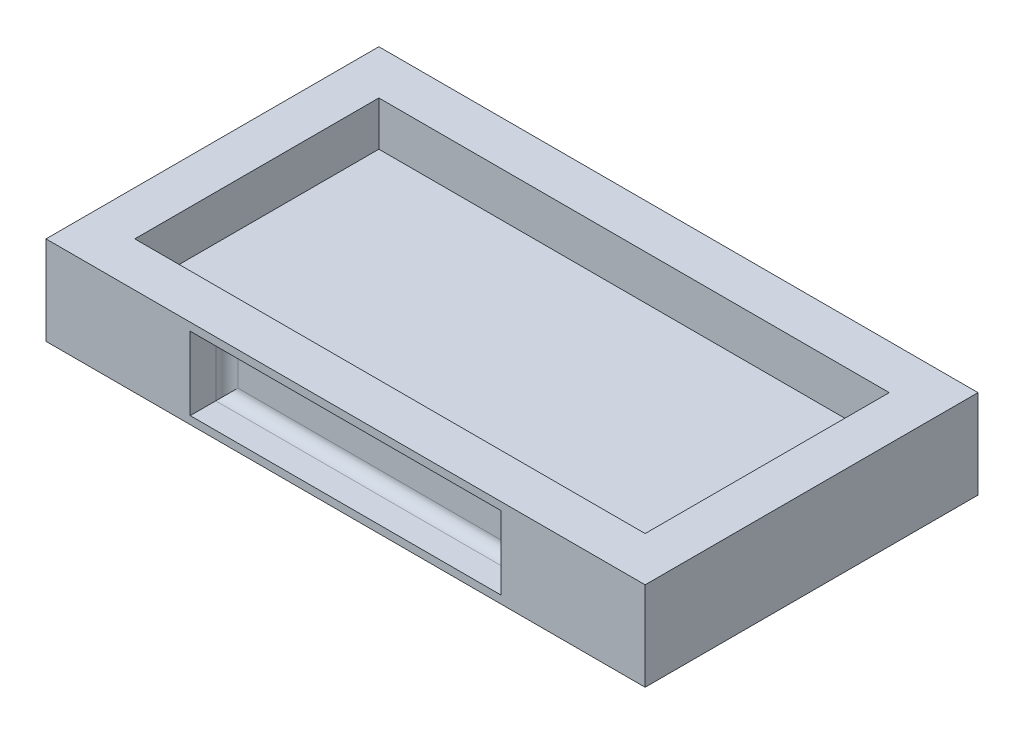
ISO-10303-21;
HEADER;
FILE_DESCRIPTION(('STEP AP214'),'2;1');
FILE_NAME('part.step','',(''),(''),'','','');
FILE_SCHEMA(('AUTOMOTIVE_DESIGN { 1 0 10303 214 1 1 1 1 }'));
ENDSEC;
DATA;
#1=APPLICATION_CONTEXT('core data for automotive mechanical design processes');
#2=APPLICATION_PROTOCOL_DEFINITION('international standard','automotive_design',2000,#1);
#3=PRODUCT_CONTEXT('',#1,'mechanical');
#4=PRODUCT('Part','Part','',(#3));
#5=PRODUCT_RELATED_PRODUCT_CATEGORY('part','',(#4));
#6=PRODUCT_DEFINITION_FORMATION('','',#4);
#7=PRODUCT_DEFINITION_CONTEXT('part definition',#1,'design');
#8=PRODUCT_DEFINITION('design','',#6,#7);
#9=PRODUCT_DEFINITION_SHAPE('','',#8);
#10=(LENGTH_UNIT() NAMED_UNIT(*) SI_UNIT(.MILLI.,.METRE.));
#11=(NAMED_UNIT(*) PLANE_ANGLE_UNIT() SI_UNIT($,.RADIAN.));
#12=(NAMED_UNIT(*) SI_UNIT($,.STERADIAN.) SOLID_ANGLE_UNIT());
#13=UNCERTAINTY_MEASURE_WITH_UNIT(LENGTH_MEASURE(1.E-05),#10,'distance_accuracy_value','');
#14=(GEOMETRIC_REPRESENTATION_CONTEXT(3) GLOBAL_UNCERTAINTY_ASSIGNED_CONTEXT((#13)) GLOBAL_UNIT_ASSIGNED_CONTEXT((#10,
#11,#12)) REPRESENTATION_CONTEXT('',''));
#15=CARTESIAN_POINT('',(0.,0.,0.));
#16=DIRECTION('',(0.,0.,1.));
#17=DIRECTION('',(1.,0.,0.));
#18=AXIS2_PLACEMENT_3D('',#15,#16,#17);
#19=CARTESIAN_POINT('',(-135.,20.,150.));
#20=DIRECTION('',(0.,-1.,0.));
#21=DIRECTION('',(0.,0.,-1.));
#22=AXIS2_PLACEMENT_3D('',#19,#20,#21);
#23=PLANE('',#22);
#24=DIRECTION('',(-1.,0.,0.));
#25=VECTOR('',#24,1.);
#26=CARTESIAN_POINT('',(-135.,20.,0.));
#27=LINE('',#26,#25);
#28=CARTESIAN_POINT('',(135.,20.,0.));
#29=VERTEX_POINT('',#28);
#30=CARTESIAN_POINT('',(-135.,20.,0.));
#31=VERTEX_POINT('',#30);
#32=EDGE_CURVE('E223',#29,#31,#27,.T.);
#33=ORIENTED_EDGE('',*,*,#32,.T.);
#34=DIRECTION('',(0.,0.,-1.));
#35=VECTOR('',#34,1.);
#36=CARTESIAN_POINT('',(-135.,20.,150.));
#37=LINE('',#36,#35);
#38=CARTESIAN_POINT('',(-135.,20.,150.));
#39=VERTEX_POINT('',#38);
#40=EDGE_CURVE('E233',#39,#31,#37,.T.);
#41=ORIENTED_EDGE('',*,*,#40,.F.);
#42=DIRECTION('',(-1.,0.,0.));
#43=VECTOR('',#42,1.);
#44=CARTESIAN_POINT('',(-135.,20.,150.));
#45=LINE('',#44,#43);
#46=CARTESIAN_POINT('',(135.,20.,150.));
#47=VERTEX_POINT('',#46);
#48=EDGE_CURVE('E213',#47,#39,#45,.T.);
#49=ORIENTED_EDGE('',*,*,#48,.F.);
#50=DIRECTION('',(0.,0.,-1.));
#51=VECTOR('',#50,1.);
#52=CARTESIAN_POINT('',(135.,20.,150.));
#53=LINE('',#52,#51);
#54=EDGE_CURVE('E236',#47,#29,#53,.T.);
#55=ORIENTED_EDGE('',*,*,#54,.T.);
#56=EDGE_LOOP('',(#33,#41,#49,#55));
#57=FACE_BOUND('',#56,.T.);
#58=DIRECTION('',(-1.,0.,0.));
#59=VECTOR('',#58,1.);
#60=CARTESIAN_POINT('',(0.,20.,20.));
#61=LINE('',#60,#59);
#62=CARTESIAN_POINT('',(115.,20.,20.));
#63=VERTEX_POINT('',#62);
#64=CARTESIAN_POINT('',(-115.,20.,20.));
#65=VERTEX_POINT('',#64);
#66=EDGE_CURVE('E183',#63,#65,#61,.T.);
#67=ORIENTED_EDGE('',*,*,#66,.F.);
#68=DIRECTION('',(0.,0.,-1.));
#69=VECTOR('',#68,1.);
#70=CARTESIAN_POINT('',(115.,20.,150.));
#71=LINE('',#70,#69);
#72=CARTESIAN_POINT('',(115.,20.,130.));
#73=VERTEX_POINT('',#72);
#74=EDGE_CURVE('E202',#73,#63,#71,.T.);
#75=ORIENTED_EDGE('',*,*,#74,.F.);
#76=DIRECTION('',(-1.,0.,0.));
#77=VECTOR('',#76,1.);
#78=CARTESIAN_POINT('',(0.,20.,130.));
#79=LINE('',#78,#77);
#80=CARTESIAN_POINT('',(-115.,20.,130.));
#81=VERTEX_POINT('',#80);
#82=EDGE_CURVE('E186',#73,#81,#79,.T.);
#83=ORIENTED_EDGE('',*,*,#82,.T.);
#84=DIRECTION('',(0.,0.,-1.));
#85=VECTOR('',#84,1.);
#86=CARTESIAN_POINT('',(-115.,20.,150.));
#87=LINE('',#86,#85);
#88=EDGE_CURVE('E199',#81,#65,#87,.T.);
#89=ORIENTED_EDGE('',*,*,#88,.T.);
#90=EDGE_LOOP('',(#67,#75,#83,#89));
#91=FACE_BOUND('',#90,.T.);
#92=ADVANCED_FACE('F51',(#57,#91),#23,.F.);
#93=CARTESIAN_POINT('',(135.,-20.,150.));
#94=DIRECTION('',(-1.,0.,0.));
#95=DIRECTION('',(0.,0.,1.));
#96=AXIS2_PLACEMENT_3D('',#93,#94,#95);
#97=PLANE('',#96);
#98=DIRECTION('',(0.,1.,0.));
#99=VECTOR('',#98,1.);
#100=CARTESIAN_POINT('',(135.,-20.,0.));
#101=LINE('',#100,#99);
#102=CARTESIAN_POINT('',(135.,-20.,0.));
#103=VERTEX_POINT('',#102);
#104=EDGE_CURVE('E204',#103,#29,#101,.T.);
#105=ORIENTED_EDGE('',*,*,#104,.T.);
#106=ORIENTED_EDGE('',*,*,#54,.F.);
#107=DIRECTION('',(0.,1.,0.));
#108=VECTOR('',#107,1.);
#109=CARTESIAN_POINT('',(135.,-20.,150.));
#110=LINE('',#109,#108);
#111=CARTESIAN_POINT('',(135.,-20.,150.));
#112=VERTEX_POINT('',#111);
#113=EDGE_CURVE('E210',#112,#47,#110,.T.);
#114=ORIENTED_EDGE('',*,*,#113,.F.);
#115=DIRECTION('',(0.,0.,-1.));
#116=VECTOR('',#115,1.);
#117=CARTESIAN_POINT('',(135.,-20.,150.));
#118=LINE('',#117,#116);
#119=EDGE_CURVE('E220',#112,#103,#118,.T.);
#120=ORIENTED_EDGE('',*,*,#119,.T.);
#121=EDGE_LOOP('',(#105,#106,#114,#120));
#122=FACE_BOUND('',#121,.T.);
#123=ADVANCED_FACE('F290',(#122),#97,.F.);
#124=CARTESIAN_POINT('',(-135.,-20.,150.));
#125=DIRECTION('',(1.,0.,0.));
#126=DIRECTION('',(0.,0.,-1.));
#127=AXIS2_PLACEMENT_3D('',#124,#125,#126);
#128=PLANE('',#127);
#129=DIRECTION('',(0.,-1.,0.));
#130=VECTOR('',#129,1.);
#131=CARTESIAN_POINT('',(-135.,-20.,0.));
#132=LINE('',#131,#130);
#133=CARTESIAN_POINT('',(-135.,-20.,0.));
#134=VERTEX_POINT('',#133);
#135=EDGE_CURVE('E225',#31,#134,#132,.T.);
#136=ORIENTED_EDGE('',*,*,#135,.T.);
#137=DIRECTION('',(0.,0.,-1.));
#138=VECTOR('',#137,1.);
#139=CARTESIAN_POINT('',(-135.,-20.,150.));
#140=LINE('',#139,#138);
#141=CARTESIAN_POINT('',(-135.,-20.,150.));
#142=VERTEX_POINT('',#141);
#143=EDGE_CURVE('E230',#142,#134,#140,.T.);
#144=ORIENTED_EDGE('',*,*,#143,.F.);
#145=DIRECTION('',(0.,-1.,0.));
#146=VECTOR('',#145,1.);
#147=CARTESIAN_POINT('',(-135.,-20.,150.));
#148=LINE('',#147,#146);
#149=EDGE_CURVE('E216',#39,#142,#148,.T.);
#150=ORIENTED_EDGE('',*,*,#149,.F.);
#151=ORIENTED_EDGE('',*,*,#40,.T.);
#152=EDGE_LOOP('',(#136,#144,#150,#151));
#153=FACE_BOUND('',#152,.T.);
#154=ADVANCED_FACE('F296',(#153),#128,.F.);
#155=CARTESIAN_POINT('',(-135.,-20.,150.));
#156=DIRECTION('',(0.,1.,0.));
#157=DIRECTION('',(0.,0.,1.));
#158=AXIS2_PLACEMENT_3D('',#155,#156,#157);
#159=PLANE('',#158);
#160=DIRECTION('',(1.,0.,0.));
#161=VECTOR('',#160,1.);
#162=CARTESIAN_POINT('',(-135.,-20.,0.));
#163=LINE('',#162,#161);
#164=EDGE_CURVE('E214',#134,#103,#163,.T.);
#165=ORIENTED_EDGE('',*,*,#164,.T.);
#166=ORIENTED_EDGE('',*,*,#119,.F.);
#167=DIRECTION('',(1.,0.,0.));
#168=VECTOR('',#167,1.);
#169=CARTESIAN_POINT('',(-135.,-20.,150.));
#170=LINE('',#169,#168);
#171=EDGE_CURVE('E218',#142,#112,#170,.T.);
#172=ORIENTED_EDGE('',*,*,#171,.F.);
#173=ORIENTED_EDGE('',*,*,#143,.T.);
#174=EDGE_LOOP('',(#165,#166,#172,#173));
#175=FACE_BOUND('',#174,.T.);
#176=ADVANCED_FACE('F373',(#175),#159,.F.);
#177=CARTESIAN_POINT('',(0.,0.,150.));
#178=DIRECTION('',(0.,0.,-1.));
#179=DIRECTION('',(-1.,0.,0.));
#180=AXIS2_PLACEMENT_3D('',#177,#178,#179);
#181=PLANE('',#180);
#182=DIRECTION('',(-1.,0.,0.));
#183=VECTOR('',#182,1.);
#184=CARTESIAN_POINT('',(-70.,16.475753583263,150.));
#185=LINE('',#184,#183);
#186=CARTESIAN_POINT('',(70.,16.475753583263,150.));
#187=VERTEX_POINT('',#186);
#188=CARTESIAN_POINT('',(-70.,16.475753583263,150.));
#189=VERTEX_POINT('',#188);
#190=EDGE_CURVE('E161',#187,#189,#185,.T.);
#191=ORIENTED_EDGE('',*,*,#190,.F.);
#192=DIRECTION('',(0.,1.,0.));
#193=VECTOR('',#192,1.);
#194=CARTESIAN_POINT('',(70.,16.475753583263,150.));
#195=LINE('',#194,#193);
#196=CARTESIAN_POINT('',(70.,-16.475753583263,150.));
#197=VERTEX_POINT('',#196);
#198=EDGE_CURVE('E166',#197,#187,#195,.T.);
#199=ORIENTED_EDGE('',*,*,#198,.F.);
#200=DIRECTION('',(1.,0.,0.));
#201=VECTOR('',#200,1.);
#202=CARTESIAN_POINT('',(-70.,-16.475753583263,150.));
#203=LINE('',#202,#201);
#204=CARTESIAN_POINT('',(-70.,-16.475753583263,150.));
#205=VERTEX_POINT('',#204);
#206=EDGE_CURVE('E171',#205,#197,#203,.T.);
#207=ORIENTED_EDGE('',*,*,#206,.F.);
#208=DIRECTION('',(0.,-1.,0.));
#209=VECTOR('',#208,1.);
#210=CARTESIAN_POINT('',(-70.,16.475753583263,150.));
#211=LINE('',#210,#209);
#212=EDGE_CURVE('E155',#189,#205,#211,.T.);
#213=ORIENTED_EDGE('',*,*,#212,.F.);
#214=EDGE_LOOP('',(#191,#199,#207,#213));
#215=FACE_BOUND('',#214,.T.);
#216=ORIENTED_EDGE('',*,*,#113,.T.);
#217=ORIENTED_EDGE('',*,*,#48,.T.);
#218=ORIENTED_EDGE('',*,*,#149,.T.);
#219=ORIENTED_EDGE('',*,*,#171,.T.);
#220=EDGE_LOOP('',(#216,#217,#218,#219));
#221=FACE_BOUND('',#220,.T.);
#222=ADVANCED_FACE('F168',(#215,#221),#181,.F.);
#223=CARTESIAN_POINT('',(0.,0.,0.));
#224=DIRECTION('',(0.,0.,-1.));
#225=DIRECTION('',(-1.,0.,0.));
#226=AXIS2_PLACEMENT_3D('',#223,#224,#225);
#227=PLANE('',#226);
#228=ORIENTED_EDGE('',*,*,#104,.F.);
#229=ORIENTED_EDGE('',*,*,#164,.F.);
#230=ORIENTED_EDGE('',*,*,#135,.F.);
#231=ORIENTED_EDGE('',*,*,#32,.F.);
#232=EDGE_LOOP('',(#228,#229,#230,#231));
#233=FACE_BOUND('',#232,.T.);
#234=ADVANCED_FACE('F372',(#233),#227,.T.);
#235=CARTESIAN_POINT('',(115.,-20.,150.));
#236=DIRECTION('',(-1.,0.,0.));
#237=DIRECTION('',(0.,0.,1.));
#238=AXIS2_PLACEMENT_3D('',#235,#236,#237);
#239=PLANE('',#238);
#240=DIRECTION('',(0.,1.,0.));
#241=VECTOR('',#240,1.);
#242=CARTESIAN_POINT('',(115.,0.,20.));
#243=LINE('',#242,#241);
#244=CARTESIAN_POINT('',(115.,0.,20.));
#245=VERTEX_POINT('',#244);
#246=EDGE_CURVE('E178',#245,#63,#243,.T.);
#247=ORIENTED_EDGE('',*,*,#246,.F.);
#248=DIRECTION('',(0.,0.,-1.));
#249=VECTOR('',#248,1.);
#250=CARTESIAN_POINT('',(115.,0.,150.));
#251=LINE('',#250,#249);
#252=CARTESIAN_POINT('',(115.,0.,130.));
#253=VERTEX_POINT('',#252);
#254=EDGE_CURVE('E188',#253,#245,#251,.T.);
#255=ORIENTED_EDGE('',*,*,#254,.F.);
#256=DIRECTION('',(0.,1.,0.));
#257=VECTOR('',#256,1.);
#258=CARTESIAN_POINT('',(115.,0.,130.));
#259=LINE('',#258,#257);
#260=EDGE_CURVE('E184',#253,#73,#259,.T.);
#261=ORIENTED_EDGE('',*,*,#260,.T.);
#262=ORIENTED_EDGE('',*,*,#74,.T.);
#263=EDGE_LOOP('',(#247,#255,#261,#262));
#264=FACE_BOUND('',#263,.T.);
#265=ADVANCED_FACE('F414',(#264),#239,.T.);
#266=CARTESIAN_POINT('',(-115.,-20.,150.));
#267=DIRECTION('',(1.,0.,0.));
#268=DIRECTION('',(0.,0.,-1.));
#269=AXIS2_PLACEMENT_3D('',#266,#267,#268);
#270=PLANE('',#269);
#271=DIRECTION('',(0.,-1.,0.));
#272=VECTOR('',#271,1.);
#273=CARTESIAN_POINT('',(-115.,0.,20.));
#274=LINE('',#273,#272);
#275=CARTESIAN_POINT('',(-115.,0.,20.));
#276=VERTEX_POINT('',#275);
#277=EDGE_CURVE('E194',#65,#276,#274,.T.);
#278=ORIENTED_EDGE('',*,*,#277,.F.);
#279=ORIENTED_EDGE('',*,*,#88,.F.);
#280=DIRECTION('',(0.,-1.,0.));
#281=VECTOR('',#280,1.);
#282=CARTESIAN_POINT('',(-115.,0.,130.));
#283=LINE('',#282,#281);
#284=CARTESIAN_POINT('',(-115.,0.,130.));
#285=VERTEX_POINT('',#284);
#286=EDGE_CURVE('E196',#81,#285,#283,.T.);
#287=ORIENTED_EDGE('',*,*,#286,.T.);
#288=DIRECTION('',(0.,0.,-1.));
#289=VECTOR('',#288,1.);
#290=CARTESIAN_POINT('',(-115.,0.,150.));
#291=LINE('',#290,#289);
#292=EDGE_CURVE('E191',#285,#276,#291,.T.);
#293=ORIENTED_EDGE('',*,*,#292,.T.);
#294=EDGE_LOOP('',(#278,#279,#287,#293));
#295=FACE_BOUND('',#294,.T.);
#296=ADVANCED_FACE('F404',(#295),#270,.T.);
#297=CARTESIAN_POINT('',(-135.,0.,150.));
#298=DIRECTION('',(0.,1.,0.));
#299=DIRECTION('',(0.,0.,1.));
#300=AXIS2_PLACEMENT_3D('',#297,#298,#299);
#301=PLANE('',#300);
#302=DIRECTION('',(1.,0.,0.));
#303=VECTOR('',#302,1.);
#304=CARTESIAN_POINT('',(0.,0.,20.));
#305=LINE('',#304,#303);
#306=EDGE_CURVE('E187',#276,#245,#305,.T.);
#307=ORIENTED_EDGE('',*,*,#306,.F.);
#308=ORIENTED_EDGE('',*,*,#292,.F.);
#309=DIRECTION('',(1.,0.,0.));
#310=VECTOR('',#309,1.);
#311=CARTESIAN_POINT('',(0.,0.,130.));
#312=LINE('',#311,#310);
#313=EDGE_CURVE('E192',#285,#253,#312,.T.);
#314=ORIENTED_EDGE('',*,*,#313,.T.);
#315=ORIENTED_EDGE('',*,*,#254,.T.);
#316=EDGE_LOOP('',(#307,#308,#314,#315));
#317=FACE_BOUND('',#316,.T.);
#318=ADVANCED_FACE('F394',(#317),#301,.T.);
#319=CARTESIAN_POINT('',(0.,0.,130.));
#320=DIRECTION('',(0.,0.,-1.));
#321=DIRECTION('',(-1.,0.,0.));
#322=AXIS2_PLACEMENT_3D('',#319,#320,#321);
#323=PLANE('',#322);
#324=ORIENTED_EDGE('',*,*,#260,.F.);
#325=ORIENTED_EDGE('',*,*,#313,.F.);
#326=ORIENTED_EDGE('',*,*,#286,.F.);
#327=ORIENTED_EDGE('',*,*,#82,.F.);
#328=EDGE_LOOP('',(#324,#325,#326,#327));
#329=FACE_BOUND('',#328,.T.);
#330=ADVANCED_FACE('F384',(#329),#323,.T.);
#331=CARTESIAN_POINT('',(0.,0.,20.));
#332=DIRECTION('',(0.,0.,-1.));
#333=DIRECTION('',(-1.,0.,0.));
#334=AXIS2_PLACEMENT_3D('',#331,#332,#333);
#335=PLANE('',#334);
#336=ORIENTED_EDGE('',*,*,#246,.T.);
#337=ORIENTED_EDGE('',*,*,#66,.T.);
#338=ORIENTED_EDGE('',*,*,#277,.T.);
#339=ORIENTED_EDGE('',*,*,#306,.T.);
#340=EDGE_LOOP('',(#336,#337,#338,#339));
#341=FACE_BOUND('',#340,.T.);
#342=ADVANCED_FACE('F361',(#341),#335,.F.);
#343=CARTESIAN_POINT('',(70.,16.475753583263,133.5));
#344=DIRECTION('',(1.,0.,0.));
#345=DIRECTION('',(0.,0.,-1.));
#346=AXIS2_PLACEMENT_3D('',#343,#344,#345);
#347=PLANE('',#346);
#348=DIRECTION('',(0.,0.,1.));
#349=VECTOR('',#348,1.);
#350=CARTESIAN_POINT('',(70.,16.475753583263,133.5));
#351=LINE('',#350,#349);
#352=CARTESIAN_POINT('',(70.,16.475753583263,138.5));
#353=VERTEX_POINT('',#352);
#354=EDGE_CURVE('E158',#353,#187,#351,.T.);
#355=ORIENTED_EDGE('',*,*,#354,.F.);
#356=DIRECTION('',(0.,1.,0.));
#357=VECTOR('',#356,1.);
#358=CARTESIAN_POINT('',(70.,16.475753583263,138.5));
#359=LINE('',#358,#357);
#360=CARTESIAN_POINT('',(70.,-16.475753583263,138.5));
#361=VERTEX_POINT('',#360);
#362=EDGE_CURVE('E13',#353,#361,#359,.F.);
#363=ORIENTED_EDGE('',*,*,#362,.T.);
#364=DIRECTION('',(0.,0.,1.));
#365=VECTOR('',#364,1.);
#366=CARTESIAN_POINT('',(70.,-16.475753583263,133.5));
#367=LINE('',#366,#365);
#368=EDGE_CURVE('E176',#361,#197,#367,.T.);
#369=ORIENTED_EDGE('',*,*,#368,.T.);
#370=ORIENTED_EDGE('',*,*,#198,.T.);
#371=EDGE_LOOP('',(#355,#363,#369,#370));
#372=FACE_BOUND('',#371,.T.);
#373=ADVANCED_FACE('F267',(#372),#347,.F.);
#374=CARTESIAN_POINT('',(-70.,-16.475753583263,133.5));
#375=DIRECTION('',(0.,-1.,0.));
#376=DIRECTION('',(0.,0.,-1.));
#377=AXIS2_PLACEMENT_3D('',#374,#375,#376);
#378=PLANE('',#377);
#379=ORIENTED_EDGE('',*,*,#368,.F.);
#380=DIRECTION('',(1.,0.,0.));
#381=VECTOR('',#380,1.);
#382=CARTESIAN_POINT('',(-70.,-16.475753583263,138.5));
#383=LINE('',#382,#381);
#384=CARTESIAN_POINT('',(-70.,-16.475753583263,138.5));
#385=VERTEX_POINT('',#384);
#386=EDGE_CURVE('E248',#361,#385,#383,.F.);
#387=ORIENTED_EDGE('',*,*,#386,.T.);
#388=DIRECTION('',(0.,0.,1.));
#389=VECTOR('',#388,1.);
#390=CARTESIAN_POINT('',(-70.,-16.475753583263,133.5));
#391=LINE('',#390,#389);
#392=EDGE_CURVE('E157',#385,#205,#391,.T.);
#393=ORIENTED_EDGE('',*,*,#392,.T.);
#394=ORIENTED_EDGE('',*,*,#206,.T.);
#395=EDGE_LOOP('',(#379,#387,#393,#394));
#396=FACE_BOUND('',#395,.T.);
#397=ADVANCED_FACE('F271',(#396),#378,.F.);
#398=CARTESIAN_POINT('',(-70.,16.475753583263,133.5));
#399=DIRECTION('',(-1.,0.,0.));
#400=DIRECTION('',(0.,0.,1.));
#401=AXIS2_PLACEMENT_3D('',#398,#399,#400);
#402=PLANE('',#401);
#403=ORIENTED_EDGE('',*,*,#392,.F.);
#404=DIRECTION('',(0.,-1.,0.));
#405=VECTOR('',#404,1.);
#406=CARTESIAN_POINT('',(-70.,16.475753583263,138.5));
#407=LINE('',#406,#405);
#408=CARTESIAN_POINT('',(-70.,16.475753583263,138.5));
#409=VERTEX_POINT('',#408);
#410=EDGE_CURVE('E75',#385,#409,#407,.F.);
#411=ORIENTED_EDGE('',*,*,#410,.T.);
#412=DIRECTION('',(0.,0.,1.));
#413=VECTOR('',#412,1.);
#414=CARTESIAN_POINT('',(-70.,16.475753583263,133.5));
#415=LINE('',#414,#413);
#416=EDGE_CURVE('E151',#409,#189,#415,.T.);
#417=ORIENTED_EDGE('',*,*,#416,.T.);
#418=ORIENTED_EDGE('',*,*,#212,.T.);
#419=EDGE_LOOP('',(#403,#411,#417,#418));
#420=FACE_BOUND('',#419,.T.);
#421=ADVANCED_FACE('F153',(#420),#402,.F.);
#422=CARTESIAN_POINT('',(-70.,16.475753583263,133.5));
#423=DIRECTION('',(0.,1.,0.));
#424=DIRECTION('',(0.,0.,1.));
#425=AXIS2_PLACEMENT_3D('',#422,#423,#424);
#426=PLANE('',#425);
#427=ORIENTED_EDGE('',*,*,#416,.F.);
#428=DIRECTION('',(-1.,0.,0.));
#429=VECTOR('',#428,1.);
#430=CARTESIAN_POINT('',(-70.,16.475753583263,138.5));
#431=LINE('',#430,#429);
#432=EDGE_CURVE('E60',#409,#353,#431,.F.);
#433=ORIENTED_EDGE('',*,*,#432,.T.);
#434=ORIENTED_EDGE('',*,*,#354,.T.);
#435=ORIENTED_EDGE('',*,*,#190,.T.);
#436=EDGE_LOOP('',(#427,#433,#434,#435));
#437=FACE_BOUND('',#436,.T.);
#438=ADVANCED_FACE('F162',(#437),#426,.F.);
#439=CARTESIAN_POINT('',(0.,0.,133.5));
#440=DIRECTION('',(0.,0.,1.));
#441=DIRECTION('',(1.,0.,0.));
#442=AXIS2_PLACEMENT_3D('',#439,#440,#441);
#443=PLANE('',#442);
#444=DIRECTION('',(0.,-1.,0.));
#445=VECTOR('',#444,1.);
#446=CARTESIAN_POINT('',(-65.,0.,133.5));
#447=LINE('',#446,#445);
#448=CARTESIAN_POINT('',(-65.,11.475753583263,133.5));
#449=VERTEX_POINT('',#448);
#450=CARTESIAN_POINT('',(-65.,-11.475753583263,133.5));
#451=VERTEX_POINT('',#450);
#452=EDGE_CURVE('E243',#449,#451,#447,.T.);
#453=ORIENTED_EDGE('',*,*,#452,.T.);
#454=DIRECTION('',(1.,0.,0.));
#455=VECTOR('',#454,1.);
#456=CARTESIAN_POINT('',(0.,-11.475753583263,133.5));
#457=LINE('',#456,#455);
#458=CARTESIAN_POINT('',(65.,-11.475753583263,133.5));
#459=VERTEX_POINT('',#458);
#460=EDGE_CURVE('E245',#451,#459,#457,.T.);
#461=ORIENTED_EDGE('',*,*,#460,.T.);
#462=DIRECTION('',(0.,1.,0.));
#463=VECTOR('',#462,1.);
#464=CARTESIAN_POINT('',(65.,0.,133.5));
#465=LINE('',#464,#463);
#466=CARTESIAN_POINT('',(65.,11.475753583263,133.5));
#467=VERTEX_POINT('',#466);
#468=EDGE_CURVE('E239',#459,#467,#465,.T.);
#469=ORIENTED_EDGE('',*,*,#468,.T.);
#470=DIRECTION('',(-1.,0.,0.));
#471=VECTOR('',#470,1.);
#472=CARTESIAN_POINT('',(0.,11.475753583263,133.5));
#473=LINE('',#472,#471);
#474=EDGE_CURVE('E241',#467,#449,#473,.T.);
#475=ORIENTED_EDGE('',*,*,#474,.T.);
#476=EDGE_LOOP('',(#453,#461,#469,#475));
#477=FACE_BOUND('',#476,.T.);
#478=ADVANCED_FACE('F280',(#477),#443,.T.);
#479=CARTESIAN_POINT('',(0.,11.475753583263,138.5));
#480=DIRECTION('',(-1.,0.,0.));
#481=DIRECTION('',(0.,0.,1.));
#482=AXIS2_PLACEMENT_3D('',#479,#480,#481);
#483=CYLINDRICAL_SURFACE('',#482,5.);
#484=CARTESIAN_POINT('',(65.,11.475753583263,138.5));
#485=DIRECTION('',(-0.707106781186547,0.707106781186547,0.));
#486=DIRECTION('',(-0.707106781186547,-0.707106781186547,0.));
#487=AXIS2_PLACEMENT_3D('',#484,#485,#486);
#488=ELLIPSE('',#487,7.07106781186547,5.);
#489=EDGE_CURVE('E256',#353,#467,#488,.T.);
#490=ORIENTED_EDGE('',*,*,#489,.F.);
#491=ORIENTED_EDGE('',*,*,#432,.F.);
#492=CARTESIAN_POINT('',(-65.,11.475753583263,138.5));
#493=DIRECTION('',(-0.707106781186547,-0.707106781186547,0.));
#494=DIRECTION('',(0.707106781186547,-0.707106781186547,0.));
#495=AXIS2_PLACEMENT_3D('',#492,#493,#494);
#496=ELLIPSE('',#495,7.07106781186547,5.);
#497=EDGE_CURVE('E55',#449,#409,#496,.F.);
#498=ORIENTED_EDGE('',*,*,#497,.F.);
#499=ORIENTED_EDGE('',*,*,#474,.F.);
#500=EDGE_LOOP('',(#490,#491,#498,#499));
#501=FACE_BOUND('',#500,.T.);
#502=ADVANCED_FACE('F53',(#501),#483,.F.);
#503=CARTESIAN_POINT('',(-65.,0.,138.5));
#504=DIRECTION('',(0.,-1.,0.));
#505=DIRECTION('',(0.,0.,-1.));
#506=AXIS2_PLACEMENT_3D('',#503,#504,#505);
#507=CYLINDRICAL_SURFACE('',#506,5.);
#508=ORIENTED_EDGE('',*,*,#497,.T.);
#509=ORIENTED_EDGE('',*,*,#410,.F.);
#510=CARTESIAN_POINT('',(-65.,-11.475753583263,138.5));
#511=DIRECTION('',(0.707106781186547,-0.707106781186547,0.));
#512=DIRECTION('',(0.707106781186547,0.707106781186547,0.));
#513=AXIS2_PLACEMENT_3D('',#510,#511,#512);
#514=ELLIPSE('',#513,7.07106781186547,5.);
#515=EDGE_CURVE('E255',#451,#385,#514,.F.);
#516=ORIENTED_EDGE('',*,*,#515,.F.);
#517=ORIENTED_EDGE('',*,*,#452,.F.);
#518=EDGE_LOOP('',(#508,#509,#516,#517));
#519=FACE_BOUND('',#518,.T.);
#520=ADVANCED_FACE('F281',(#519),#507,.F.);
#521=CARTESIAN_POINT('',(65.,0.,138.5));
#522=DIRECTION('',(0.,1.,0.));
#523=DIRECTION('',(0.,0.,1.));
#524=AXIS2_PLACEMENT_3D('',#521,#522,#523);
#525=CYLINDRICAL_SURFACE('',#524,5.);
#526=ORIENTED_EDGE('',*,*,#489,.T.);
#527=ORIENTED_EDGE('',*,*,#468,.F.);
#528=CARTESIAN_POINT('',(65.,-11.475753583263,138.5));
#529=DIRECTION('',(0.707106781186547,0.707106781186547,0.));
#530=DIRECTION('',(0.707106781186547,-0.707106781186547,0.));
#531=AXIS2_PLACEMENT_3D('',#528,#529,#530);
#532=ELLIPSE('',#531,7.07106781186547,5.);
#533=EDGE_CURVE('E253',#361,#459,#532,.T.);
#534=ORIENTED_EDGE('',*,*,#533,.F.);
#535=ORIENTED_EDGE('',*,*,#362,.F.);
#536=EDGE_LOOP('',(#526,#527,#534,#535));
#537=FACE_BOUND('',#536,.T.);
#538=ADVANCED_FACE('F277',(#537),#525,.F.);
#539=CARTESIAN_POINT('',(0.,-11.475753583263,138.5));
#540=DIRECTION('',(1.,0.,0.));
#541=DIRECTION('',(0.,0.,-1.));
#542=AXIS2_PLACEMENT_3D('',#539,#540,#541);
#543=CYLINDRICAL_SURFACE('',#542,5.);
#544=ORIENTED_EDGE('',*,*,#515,.T.);
#545=ORIENTED_EDGE('',*,*,#386,.F.);
#546=ORIENTED_EDGE('',*,*,#533,.T.);
#547=ORIENTED_EDGE('',*,*,#460,.F.);
#548=EDGE_LOOP('',(#544,#545,#546,#547));
#549=FACE_BOUND('',#548,.T.);
#550=ADVANCED_FACE('F274',(#549),#543,.F.);
#551=CLOSED_SHELL('',(#92,#123,#154,#176,#222,#234,#265,#296,#318,#330,#342,#373,#397,#421,#438,
#478,#502,#520,#538,#550));
#552=MANIFOLD_SOLID_BREP('B2',#551);
#553=ADVANCED_BREP_SHAPE_REPRESENTATION('',(#18,#552),#14);
#554=SHAPE_DEFINITION_REPRESENTATION(#9,#553);
ENDSEC;
END-ISO-10303-21;
